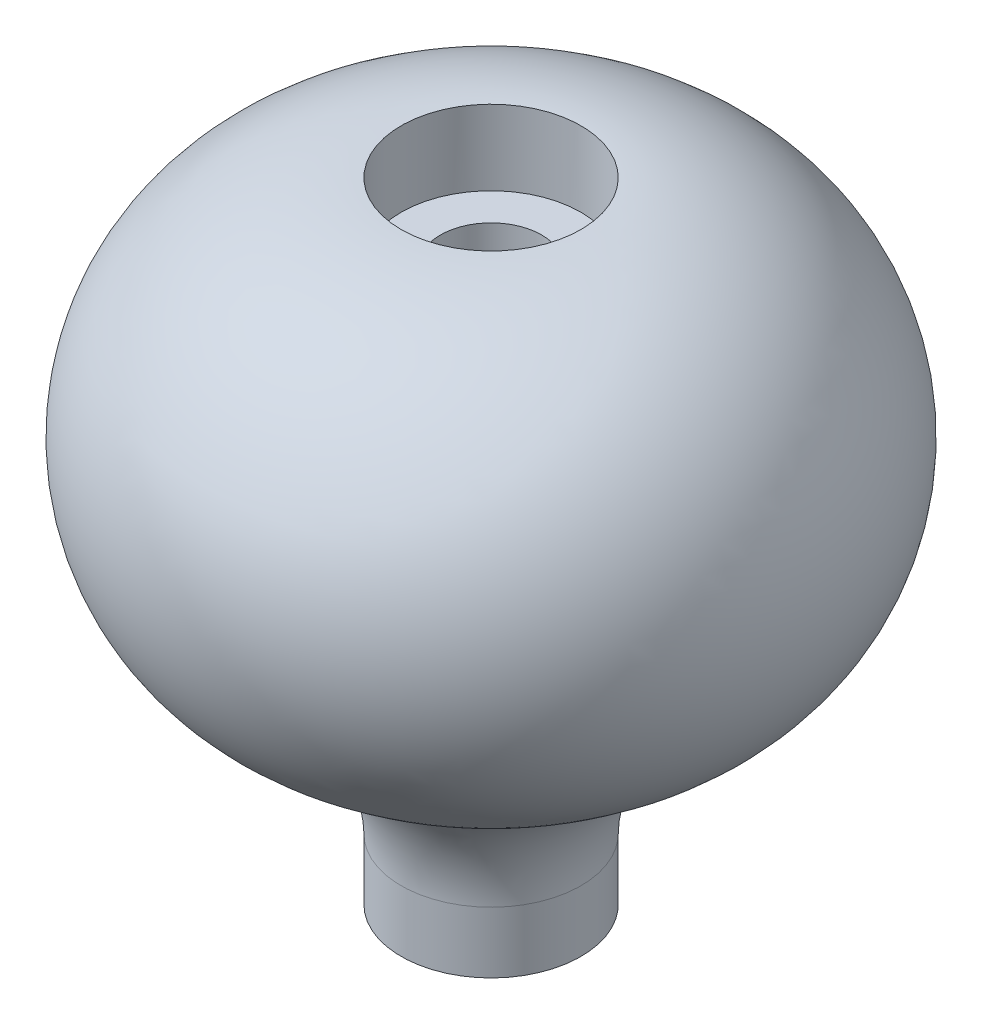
ISO-10303-21;
HEADER;
FILE_DESCRIPTION(('STEP AP214'),'2;1');
FILE_NAME('part.step','',(''),(''),'','','');
FILE_SCHEMA(('AUTOMOTIVE_DESIGN { 1 0 10303 214 1 1 1 1 }'));
ENDSEC;
DATA;
#1=APPLICATION_CONTEXT('core data for automotive mechanical design processes');
#2=APPLICATION_PROTOCOL_DEFINITION('international standard','automotive_design',2000,#1);
#3=PRODUCT_CONTEXT('',#1,'mechanical');
#4=PRODUCT('Part','Part','',(#3));
#5=PRODUCT_RELATED_PRODUCT_CATEGORY('part','',(#4));
#6=PRODUCT_DEFINITION_FORMATION('','',#4);
#7=PRODUCT_DEFINITION_CONTEXT('part definition',#1,'design');
#8=PRODUCT_DEFINITION('design','',#6,#7);
#9=PRODUCT_DEFINITION_SHAPE('','',#8);
#10=(LENGTH_UNIT() NAMED_UNIT(*) SI_UNIT(.MILLI.,.METRE.));
#11=(NAMED_UNIT(*) PLANE_ANGLE_UNIT() SI_UNIT($,.RADIAN.));
#12=(NAMED_UNIT(*) SI_UNIT($,.STERADIAN.) SOLID_ANGLE_UNIT());
#13=UNCERTAINTY_MEASURE_WITH_UNIT(LENGTH_MEASURE(1.E-05),#10,'distance_accuracy_value','');
#14=(GEOMETRIC_REPRESENTATION_CONTEXT(3) GLOBAL_UNCERTAINTY_ASSIGNED_CONTEXT((#13)) GLOBAL_UNIT_ASSIGNED_CONTEXT((#10,
#11,#12)) REPRESENTATION_CONTEXT('',''));
#15=CARTESIAN_POINT('',(0.,0.,0.));
#16=DIRECTION('',(0.,0.,1.));
#17=DIRECTION('',(1.,0.,0.));
#18=AXIS2_PLACEMENT_3D('',#15,#16,#17);
#19=CARTESIAN_POINT('',(0.,0.,0.));
#20=DIRECTION('',(0.,-1.,0.));
#21=DIRECTION('',(0.,0.,-1.));
#22=AXIS2_PLACEMENT_3D('',#19,#20,#21);
#23=PLANE('',#22);
#24=CARTESIAN_POINT('',(0.,0.,0.));
#25=DIRECTION('',(0.,-1.,0.));
#26=DIRECTION('',(0.,0.,-1.));
#27=AXIS2_PLACEMENT_3D('',#24,#25,#26);
#28=CIRCLE('',#27,3.3782);
#29=CARTESIAN_POINT('',(0.,0.,-3.3782));
#30=VERTEX_POINT('',#29);
#31=EDGE_CURVE('E49',#30,#30,#28,.T.);
#32=ORIENTED_EDGE('',*,*,#31,.F.);
#33=EDGE_LOOP('',(#32));
#34=FACE_BOUND('',#33,.T.);
#35=CARTESIAN_POINT('',(0.,0.,0.));
#36=DIRECTION('',(0.,-1.,0.));
#37=DIRECTION('',(0.,0.,-1.));
#38=AXIS2_PLACEMENT_3D('',#35,#36,#37);
#39=CIRCLE('',#38,6.);
#40=CARTESIAN_POINT('',(0.,0.,-6.));
#41=VERTEX_POINT('',#40);
#42=EDGE_CURVE('E45',#41,#41,#39,.T.);
#43=ORIENTED_EDGE('',*,*,#42,.T.);
#44=EDGE_LOOP('',(#43));
#45=FACE_BOUND('',#44,.T.);
#46=ADVANCED_FACE('F34',(#34,#45),#23,.T.);
#47=CARTESIAN_POINT('',(0.,0.,0.));
#48=DIRECTION('',(0.,-1.,0.));
#49=DIRECTION('',(0.,0.,-1.));
#50=AXIS2_PLACEMENT_3D('',#47,#48,#49);
#51=CYLINDRICAL_SURFACE('',#50,6.);
#52=CARTESIAN_POINT('',(0.,4.08712152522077,0.));
#53=DIRECTION('',(0.,-1.,0.));
#54=DIRECTION('',(0.,0.,-1.));
#55=AXIS2_PLACEMENT_3D('',#52,#53,#54);
#56=CIRCLE('',#55,6.);
#57=CARTESIAN_POINT('',(0.,4.08712152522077,-6.));
#58=VERTEX_POINT('',#57);
#59=EDGE_CURVE('E41',#58,#58,#56,.T.);
#60=ORIENTED_EDGE('',*,*,#59,.T.);
#61=EDGE_LOOP('',(#60));
#62=FACE_BOUND('',#61,.T.);
#63=ORIENTED_EDGE('',*,*,#42,.F.);
#64=EDGE_LOOP('',(#63));
#65=FACE_BOUND('',#64,.T.);
#66=ADVANCED_FACE('F70',(#62,#65),#51,.T.);
#67=CARTESIAN_POINT('',(0.,27.,0.));
#68=DIRECTION('',(0.,-1.,0.));
#69=DIRECTION('',(0.,0.,-1.));
#70=AXIS2_PLACEMENT_3D('',#67,#68,#69);
#71=DEGENERATE_TOROIDAL_SURFACE('',#70,6.,15.,.T.);
#72=CARTESIAN_POINT('',(0.,13.2522729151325,0.));
#73=DIRECTION('',(0.,1.,0.));
#74=DIRECTION('',(0.,0.,1.));
#75=AXIS2_PLACEMENT_3D('',#72,#73,#74);
#76=CIRCLE('',#75,12.);
#77=CARTESIAN_POINT('',(0.,13.2522729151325,12.));
#78=VERTEX_POINT('',#77);
#79=EDGE_CURVE('E11',#78,#78,#76,.T.);
#80=ORIENTED_EDGE('',*,*,#79,.T.);
#81=EDGE_LOOP('',(#80));
#82=FACE_BOUND('',#81,.T.);
#83=CARTESIAN_POINT('',(0.,42.,0.));
#84=DIRECTION('',(0.,1.,0.));
#85=DIRECTION('',(0.,0.,1.));
#86=AXIS2_PLACEMENT_3D('',#83,#84,#85);
#87=CIRCLE('',#86,6.);
#88=CARTESIAN_POINT('',(0.,42.,6.));
#89=VERTEX_POINT('',#88);
#90=EDGE_CURVE('E60',#89,#89,#87,.T.);
#91=ORIENTED_EDGE('',*,*,#90,.F.);
#92=EDGE_LOOP('',(#91));
#93=FACE_BOUND('',#92,.T.);
#94=ADVANCED_FACE('F67',(#82,#93),#71,.T.);
#95=CARTESIAN_POINT('',(0.,0.,0.));
#96=DIRECTION('',(0.,-1.,0.));
#97=DIRECTION('',(0.,0.,-1.));
#98=AXIS2_PLACEMENT_3D('',#95,#96,#97);
#99=CYLINDRICAL_SURFACE('',#98,3.3782);
#100=CARTESIAN_POINT('',(0.,37.,0.));
#101=DIRECTION('',(0.,-1.,0.));
#102=DIRECTION('',(0.,0.,-1.));
#103=AXIS2_PLACEMENT_3D('',#100,#101,#102);
#104=CIRCLE('',#103,3.3782);
#105=CARTESIAN_POINT('',(0.,37.,-3.3782));
#106=VERTEX_POINT('',#105);
#107=EDGE_CURVE('E52',#106,#106,#104,.F.);
#108=ORIENTED_EDGE('',*,*,#107,.T.);
#109=EDGE_LOOP('',(#108));
#110=FACE_BOUND('',#109,.T.);
#111=ORIENTED_EDGE('',*,*,#31,.T.);
#112=EDGE_LOOP('',(#111));
#113=FACE_BOUND('',#112,.T.);
#114=ADVANCED_FACE('F69',(#110,#113),#99,.F.);
#115=CARTESIAN_POINT('',(0.,37.,0.));
#116=DIRECTION('',(0.,-1.,0.));
#117=DIRECTION('',(0.,0.,-1.));
#118=AXIS2_PLACEMENT_3D('',#115,#116,#117);
#119=PLANE('',#118);
#120=CARTESIAN_POINT('',(0.,37.,0.));
#121=DIRECTION('',(0.,-1.,0.));
#122=DIRECTION('',(0.,0.,-1.));
#123=AXIS2_PLACEMENT_3D('',#120,#121,#122);
#124=CIRCLE('',#123,6.);
#125=CARTESIAN_POINT('',(0.,37.,-6.));
#126=VERTEX_POINT('',#125);
#127=EDGE_CURVE('E54',#126,#126,#124,.F.);
#128=ORIENTED_EDGE('',*,*,#127,.T.);
#129=EDGE_LOOP('',(#128));
#130=FACE_BOUND('',#129,.T.);
#131=ORIENTED_EDGE('',*,*,#107,.F.);
#132=EDGE_LOOP('',(#131));
#133=FACE_BOUND('',#132,.T.);
#134=ADVANCED_FACE('F76',(#130,#133),#119,.F.);
#135=CARTESIAN_POINT('',(0.,-16.9705627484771,0.));
#136=DIRECTION('',(0.,1.,0.));
#137=DIRECTION('',(0.,0.,1.));
#138=AXIS2_PLACEMENT_3D('',#135,#136,#137);
#139=CYLINDRICAL_SURFACE('',#138,6.);
#140=ORIENTED_EDGE('',*,*,#90,.T.);
#141=EDGE_LOOP('',(#140));
#142=FACE_BOUND('',#141,.T.);
#143=ORIENTED_EDGE('',*,*,#127,.F.);
#144=EDGE_LOOP('',(#143));
#145=FACE_BOUND('',#144,.T.);
#146=ADVANCED_FACE('F64',(#142,#145),#139,.F.);
#147=CARTESIAN_POINT('',(0.,4.08712152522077,0.));
#148=DIRECTION('',(0.,-1.,0.));
#149=DIRECTION('',(0.,0.,-1.));
#150=AXIS2_PLACEMENT_3D('',#147,#148,#149);
#151=TOROIDAL_SURFACE('',#150,16.,10.);
#152=ORIENTED_EDGE('',*,*,#79,.F.);
#153=EDGE_LOOP('',(#152));
#154=FACE_BOUND('',#153,.T.);
#155=ORIENTED_EDGE('',*,*,#59,.F.);
#156=EDGE_LOOP('',(#155));
#157=FACE_BOUND('',#156,.T.);
#158=ADVANCED_FACE('F36',(#154,#157),#151,.F.);
#159=CLOSED_SHELL('',(#46,#66,#94,#114,#134,#146,#158));
#160=MANIFOLD_SOLID_BREP('B2',#159);
#161=ADVANCED_BREP_SHAPE_REPRESENTATION('',(#18,#160),#14);
#162=SHAPE_DEFINITION_REPRESENTATION(#9,#161);
ENDSEC;
END-ISO-10303-21;
